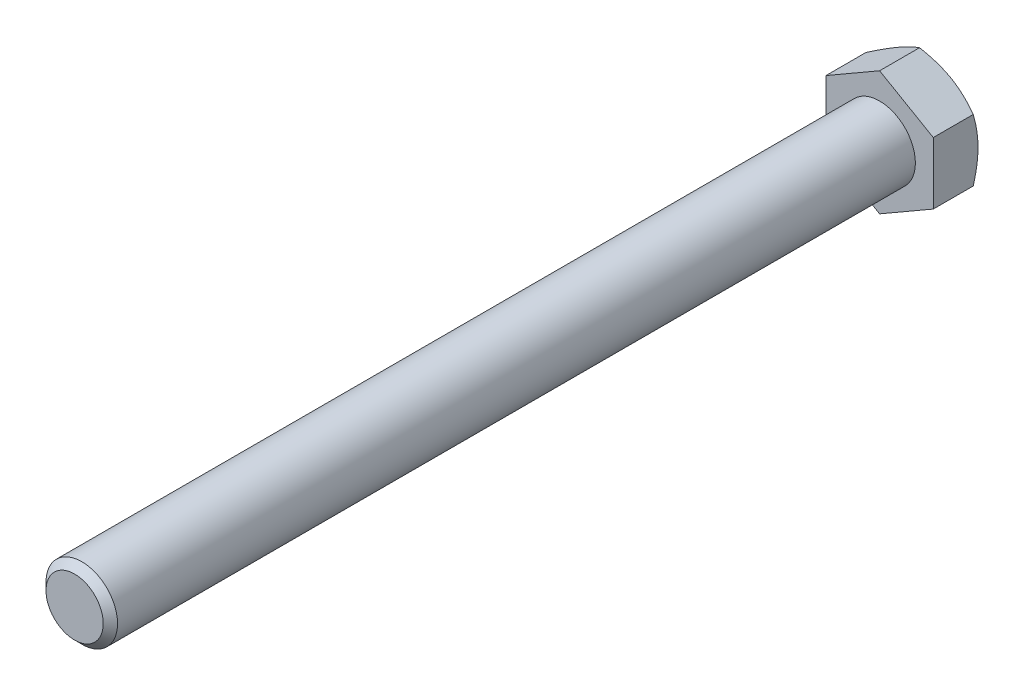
ISO-10303-21;
HEADER;
FILE_DESCRIPTION(('STEP AP214'),'2;1');
FILE_NAME('part.step','',(''),(''),'','','');
FILE_SCHEMA(('AUTOMOTIVE_DESIGN { 1 0 10303 214 1 1 1 1 }'));
ENDSEC;
DATA;
#1=APPLICATION_CONTEXT('core data for automotive mechanical design processes');
#2=APPLICATION_PROTOCOL_DEFINITION('international standard','automotive_design',2000,#1);
#3=PRODUCT_CONTEXT('',#1,'mechanical');
#4=PRODUCT('Part','Part','',(#3));
#5=PRODUCT_RELATED_PRODUCT_CATEGORY('part','',(#4));
#6=PRODUCT_DEFINITION_FORMATION('','',#4);
#7=PRODUCT_DEFINITION_CONTEXT('part definition',#1,'design');
#8=PRODUCT_DEFINITION('design','',#6,#7);
#9=PRODUCT_DEFINITION_SHAPE('','',#8);
#10=(LENGTH_UNIT() NAMED_UNIT(*) SI_UNIT(.MILLI.,.METRE.));
#11=(NAMED_UNIT(*) PLANE_ANGLE_UNIT() SI_UNIT($,.RADIAN.));
#12=(NAMED_UNIT(*) SI_UNIT($,.STERADIAN.) SOLID_ANGLE_UNIT());
#13=UNCERTAINTY_MEASURE_WITH_UNIT(LENGTH_MEASURE(1.E-05),#10,'distance_accuracy_value','');
#14=(GEOMETRIC_REPRESENTATION_CONTEXT(3) GLOBAL_UNCERTAINTY_ASSIGNED_CONTEXT((#13)) GLOBAL_UNIT_ASSIGNED_CONTEXT((#10,
#11,#12)) REPRESENTATION_CONTEXT('',''));
#15=CARTESIAN_POINT('',(0.,0.,0.));
#16=DIRECTION('',(0.,0.,1.));
#17=DIRECTION('',(1.,0.,0.));
#18=AXIS2_PLACEMENT_3D('',#15,#16,#17);
#19=CARTESIAN_POINT('',(0.,0.,180.));
#20=DIRECTION('',(0.,0.,1.));
#21=DIRECTION('',(1.,0.,0.));
#22=AXIS2_PLACEMENT_3D('',#19,#20,#21);
#23=PLANE('',#22);
#24=CARTESIAN_POINT('',(0.,0.,180.));
#25=DIRECTION('',(0.,0.,1.));
#26=DIRECTION('',(1.,0.,0.));
#27=AXIS2_PLACEMENT_3D('',#24,#25,#26);
#28=CIRCLE('',#27,6.39999999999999);
#29=CARTESIAN_POINT('',(6.40000000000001,0.,180.));
#30=VERTEX_POINT('',#29);
#31=EDGE_CURVE('E203',#30,#30,#28,.T.);
#32=ORIENTED_EDGE('',*,*,#31,.T.);
#33=EDGE_LOOP('',(#32));
#34=FACE_BOUND('',#33,.T.);
#35=ADVANCED_FACE('F29',(#34),#23,.T.);
#36=CARTESIAN_POINT('',(0.,0.,0.));
#37=DIRECTION('',(0.,0.,1.));
#38=DIRECTION('',(1.,0.,0.));
#39=AXIS2_PLACEMENT_3D('',#36,#37,#38);
#40=CYLINDRICAL_SURFACE('',#39,8.);
#41=CARTESIAN_POINT('',(0.,0.,178.4));
#42=DIRECTION('',(0.,0.,1.));
#43=DIRECTION('',(1.,0.,0.));
#44=AXIS2_PLACEMENT_3D('',#41,#42,#43);
#45=CIRCLE('',#44,8.);
#46=CARTESIAN_POINT('',(8.00000000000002,0.,178.4));
#47=VERTEX_POINT('',#46);
#48=EDGE_CURVE('E205',#47,#47,#45,.F.);
#49=ORIENTED_EDGE('',*,*,#48,.T.);
#50=EDGE_LOOP('',(#49));
#51=FACE_BOUND('',#50,.T.);
#52=CARTESIAN_POINT('',(0.,0.,0.));
#53=DIRECTION('',(0.,0.,1.));
#54=DIRECTION('',(1.,0.,0.));
#55=AXIS2_PLACEMENT_3D('',#52,#53,#54);
#56=CIRCLE('',#55,8.);
#57=CARTESIAN_POINT('',(8.,0.,0.));
#58=VERTEX_POINT('',#57);
#59=EDGE_CURVE('E206',#58,#58,#56,.F.);
#60=ORIENTED_EDGE('',*,*,#59,.F.);
#61=EDGE_LOOP('',(#60));
#62=FACE_BOUND('',#61,.T.);
#63=ADVANCED_FACE('F194',(#51,#62),#40,.T.);
#64=CARTESIAN_POINT('',(0.,0.,180.));
#65=DIRECTION('',(0.,0.,-1.));
#66=DIRECTION('',(-1.,0.,0.));
#67=AXIS2_PLACEMENT_3D('',#64,#65,#66);
#68=CONICAL_SURFACE('',#67,6.39999999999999,0.785398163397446);
#69=ORIENTED_EDGE('',*,*,#48,.F.);
#70=EDGE_LOOP('',(#69));
#71=FACE_BOUND('',#70,.T.);
#72=ORIENTED_EDGE('',*,*,#31,.F.);
#73=EDGE_LOOP('',(#72));
#74=FACE_BOUND('',#73,.T.);
#75=ADVANCED_FACE('F199',(#71,#74),#68,.T.);
#76=CARTESIAN_POINT('',(0.,13.856406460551,-10.));
#77=DIRECTION('',(0.499999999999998,0.86602540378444,0.));
#78=DIRECTION('',(-0.86602540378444,0.499999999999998,0.));
#79=AXIS2_PLACEMENT_3D('',#76,#77,#78);
#80=PLANE('',#79);
#81=CARTESIAN_POINT('',(-0.000200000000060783,13.8565219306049,-8.9281365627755));
#82=CARTESIAN_POINT('',(0.263585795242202,13.7042251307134,-9.01605036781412));
#83=CARTESIAN_POINT('',(0.528355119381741,13.5513604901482,-9.09997400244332));
#84=CARTESIAN_POINT('',(1.0600170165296,13.2444053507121,-9.25873378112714));
#85=CARTESIAN_POINT('',(1.32691025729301,13.0903144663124,-9.3335669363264));
#86=CARTESIAN_POINT('',(2.13189040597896,12.6255589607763,-9.54298246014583));
#87=CARTESIAN_POINT('',(2.67315507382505,12.3130596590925,-9.66209676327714));
#88=CARTESIAN_POINT('',(3.48313282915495,11.8454187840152,-9.80176893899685));
#89=CARTESIAN_POINT('',(3.74942610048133,11.6916742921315,-9.84155620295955));
#90=CARTESIAN_POINT('',(4.2832455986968,11.3834734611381,-9.90827663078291));
#91=CARTESIAN_POINT('',(4.55077184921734,11.2290171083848,-9.93520954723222));
#92=CARTESIAN_POINT('',(5.08627036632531,10.9198468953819,-9.97553140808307));
#93=CARTESIAN_POINT('',(5.35424172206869,10.7651335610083,-9.98893644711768));
#94=CARTESIAN_POINT('',(5.890432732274,10.4555635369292,-10.0019169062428));
#95=CARTESIAN_POINT('',(6.158652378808,10.3007068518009,-10.0014927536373));
#96=CARTESIAN_POINT('',(6.66008937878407,10.0112020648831,-9.98777998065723));
#97=CARTESIAN_POINT('',(6.89334249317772,9.87653331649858,-9.97616401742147));
#98=CARTESIAN_POINT('',(7.35931224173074,9.60750555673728,-9.94269199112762));
#99=CARTESIAN_POINT('',(7.59202883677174,9.47314656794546,-9.92083520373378));
#100=CARTESIAN_POINT('',(8.05679907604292,9.20481134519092,-9.86726258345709));
#101=CARTESIAN_POINT('',(8.28885201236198,9.07083551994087,-9.83553860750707));
#102=CARTESIAN_POINT('',(8.75186996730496,8.80351197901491,-9.76278822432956));
#103=CARTESIAN_POINT('',(8.98283491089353,8.67016430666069,-9.7217611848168));
#104=CARTESIAN_POINT('',(9.68394195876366,8.26537996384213,-9.58368834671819));
#105=CARTESIAN_POINT('',(10.1520537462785,7.99511549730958,-9.47287511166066));
#106=CARTESIAN_POINT('',(11.0812971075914,7.45861659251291,-9.2213742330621));
#107=CARTESIAN_POINT('',(11.5424405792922,7.19237528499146,-9.0807456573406));
#108=CARTESIAN_POINT('',(12.0002,6.92808776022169,-8.92813656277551));
#109=B_SPLINE_CURVE_WITH_KNOTS('',3,(#81,#82,#83,#84,#85,#86,#87,#88,#89,#90,#91,#92,#93,#94,
#95,#96,#97,#98,#99,#100,#101,#102,#103,#104,#105,#106,#107,#108),.UNSPECIFIED.,.F.,.F.,(4,2,2,
2,2,2,2,2,2,2,2,2,2,4),(0.,0.951004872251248,1.90232158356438,3.8090046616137,4.73894551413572,
5.66890426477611,6.59775529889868,7.52657763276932,8.33514643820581,9.14377244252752,
9.95306755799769,10.7624176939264,12.4167102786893,14.0677556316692),.UNSPECIFIED.);
#110=CARTESIAN_POINT('',(0.,13.856406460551,-8.9282032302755));
#111=VERTEX_POINT('',#110);
#112=CARTESIAN_POINT('',(5.99999999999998,10.3923048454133,-10.));
#113=VERTEX_POINT('',#112);
#114=EDGE_CURVE('E239',#111,#113,#109,.T.);
#115=ORIENTED_EDGE('',*,*,#114,.F.);
#116=DIRECTION('',(0.,0.,1.));
#117=VECTOR('',#116,1.);
#118=CARTESIAN_POINT('',(0.,13.856406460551,-10.));
#119=LINE('',#118,#117);
#120=CARTESIAN_POINT('',(0.,13.856406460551,0.));
#121=VERTEX_POINT('',#120);
#122=EDGE_CURVE('E213',#111,#121,#119,.T.);
#123=ORIENTED_EDGE('',*,*,#122,.T.);
#124=DIRECTION('',(-0.86602540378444,0.499999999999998,0.));
#125=VECTOR('',#124,1.);
#126=CARTESIAN_POINT('',(0.,13.856406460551,0.));
#127=LINE('',#126,#125);
#128=CARTESIAN_POINT('',(12.,6.92820323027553,0.));
#129=VERTEX_POINT('',#128);
#130=EDGE_CURVE('E237',#129,#121,#127,.T.);
#131=ORIENTED_EDGE('',*,*,#130,.F.);
#132=DIRECTION('',(0.,0.,1.));
#133=VECTOR('',#132,1.);
#134=CARTESIAN_POINT('',(12.,6.92820323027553,-10.));
#135=LINE('',#134,#133);
#136=CARTESIAN_POINT('',(12.,6.92820323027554,-8.9282032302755));
#137=VERTEX_POINT('',#136);
#138=EDGE_CURVE('E210',#137,#129,#135,.T.);
#139=ORIENTED_EDGE('',*,*,#138,.F.);
#140=EDGE_CURVE('E169',#113,#137,#109,.T.);
#141=ORIENTED_EDGE('',*,*,#140,.F.);
#142=EDGE_LOOP('',(#115,#123,#131,#139,#141));
#143=FACE_BOUND('',#142,.T.);
#144=ADVANCED_FACE('F179',(#143),#80,.T.);
#145=CARTESIAN_POINT('',(12.,-6.92820323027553,-10.));
#146=DIRECTION('',(1.,0.,0.));
#147=DIRECTION('',(0.,0.,-1.));
#148=AXIS2_PLACEMENT_3D('',#145,#146,#147);
#149=PLANE('',#148);
#150=CARTESIAN_POINT('',(12.,-18.9250739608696,-3.99042361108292));
#151=CARTESIAN_POINT('',(12.,-18.6616294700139,-4.1188745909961));
#152=CARTESIAN_POINT('',(12.,-18.3978841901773,-4.24670838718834));
#153=CARTESIAN_POINT('',(12.,-17.869729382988,-4.50100240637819));
#154=CARTESIAN_POINT('',(12.,-17.6053198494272,-4.62746261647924));
#155=CARTESIAN_POINT('',(12.,-16.8109346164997,-5.00460542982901));
#156=CARTESIAN_POINT('',(12.,-16.2798755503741,-5.25301439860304));
#157=CARTESIAN_POINT('',(12.,-15.2115652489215,-5.74359590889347));
#158=CARTESIAN_POINT('',(12.,-14.6742962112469,-5.98572977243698));
#159=CARTESIAN_POINT('',(12.,-13.5955935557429,-6.46050256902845));
#160=CARTESIAN_POINT('',(12.,-13.054160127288,-6.69314193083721));
#161=CARTESIAN_POINT('',(12.,-11.9477551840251,-7.15413664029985));
#162=CARTESIAN_POINT('',(12.,-11.3826097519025,-7.38207667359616));
#163=CARTESIAN_POINT('',(12.,-10.2458209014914,-7.82145679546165));
#164=CARTESIAN_POINT('',(12.,-9.67417677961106,-8.03289507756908));
#165=CARTESIAN_POINT('',(12.,-8.5244701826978,-8.43394793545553));
#166=CARTESIAN_POINT('',(12.,-7.94642231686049,-8.62360406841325));
#167=CARTESIAN_POINT('',(12.,-6.78198793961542,-8.97522909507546));
#168=CARTESIAN_POINT('',(12.,-6.19560401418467,-9.13720638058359));
#169=CARTESIAN_POINT('',(12.,-5.311253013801,-9.35327296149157));
#170=CARTESIAN_POINT('',(12.,-5.0165168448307,-9.42065839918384));
#171=CARTESIAN_POINT('',(12.,-4.42497462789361,-9.54568693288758));
#172=CARTESIAN_POINT('',(12.,-4.12816861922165,-9.60333021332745));
#173=CARTESIAN_POINT('',(12.,-3.53266972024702,-9.7078772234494));
#174=CARTESIAN_POINT('',(12.,-3.23397688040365,-9.75478123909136));
#175=CARTESIAN_POINT('',(12.,-2.63499315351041,-9.8369274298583));
#176=CARTESIAN_POINT('',(12.,-2.33470233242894,-9.87217008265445));
#177=CARTESIAN_POINT('',(12.,-1.73700046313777,-9.9298331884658));
#178=CARTESIAN_POINT('',(12.,-1.43960568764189,-9.95242127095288));
#179=CARTESIAN_POINT('',(12.,-0.84412690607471,-9.98498816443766));
#180=CARTESIAN_POINT('',(12.,-0.54604291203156,-9.99496719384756));
#181=CARTESIAN_POINT('',(12.,0.0502829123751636,-10.002076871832));
#182=CARTESIAN_POINT('',(12.,0.348524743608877,-9.99920744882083));
#183=CARTESIAN_POINT('',(12.,0.944614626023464,-9.9806935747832));
#184=CARTESIAN_POINT('',(12.,1.24246265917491,-9.96504855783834));
#185=CARTESIAN_POINT('',(12.,1.94883669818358,-9.91313385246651));
#186=CARTESIAN_POINT('',(12.,2.3569653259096,-9.87132867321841));
#187=CARTESIAN_POINT('',(12.,3.17037872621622,-9.7659412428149));
#188=CARTESIAN_POINT('',(12.,3.57566314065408,-9.70235629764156));
#189=CARTESIAN_POINT('',(12.,4.78667114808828,-9.48228853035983));
#190=CARTESIAN_POINT('',(12.,5.58715478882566,-9.29652578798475));
#191=CARTESIAN_POINT('',(12.,6.78477534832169,-8.97197381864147));
#192=CARTESIAN_POINT('',(12.,7.18805346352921,-8.85452170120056));
#193=CARTESIAN_POINT('',(12.,7.99069893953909,-8.60681919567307));
#194=CARTESIAN_POINT('',(12.,8.39006626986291,-8.47656870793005));
#195=CARTESIAN_POINT('',(12.,9.18500745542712,-8.20540698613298));
#196=CARTESIAN_POINT('',(12.,9.58058232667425,-8.06449870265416));
#197=CARTESIAN_POINT('',(12.,10.3684152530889,-7.7737455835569));
#198=CARTESIAN_POINT('',(12.,10.7606733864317,-7.62390095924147));
#199=CARTESIAN_POINT('',(12.,11.4875161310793,-7.33823544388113));
#200=CARTESIAN_POINT('',(12.,11.8224853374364,-7.20338895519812));
#201=CARTESIAN_POINT('',(12.,12.4904657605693,-6.92892402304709));
#202=CARTESIAN_POINT('',(12.,12.8234769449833,-6.7893055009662));
#203=CARTESIAN_POINT('',(12.,13.8199414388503,-6.364274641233));
#204=CARTESIAN_POINT('',(12.,14.4807713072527,-6.07270863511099));
#205=CARTESIAN_POINT('',(12.,15.7970784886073,-5.47713534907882));
#206=CARTESIAN_POINT('',(12.,16.4525535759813,-5.17312318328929));
#207=CARTESIAN_POINT('',(12.,17.7589886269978,-4.55563924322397));
#208=CARTESIAN_POINT('',(12.,18.4099487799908,-4.24216786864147));
#209=CARTESIAN_POINT('',(12.,19.7093218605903,-3.60732416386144));
#210=CARTESIAN_POINT('',(12.,20.357728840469,-3.28593969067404));
#211=CARTESIAN_POINT('',(12.,21.6516057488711,-2.63730730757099));
#212=CARTESIAN_POINT('',(12.,22.2970756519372,-2.31005934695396));
#213=CARTESIAN_POINT('',(12.,23.5854613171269,-1.65093387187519));
#214=CARTESIAN_POINT('',(12.,24.2283776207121,-1.31905741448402));
#215=CARTESIAN_POINT('',(12.,25.5122149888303,-0.651476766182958));
#216=CARTESIAN_POINT('',(12.,26.1531360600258,-0.315772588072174));
#217=CARTESIAN_POINT('',(12.,27.9362828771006,0.623783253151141));
#218=CARTESIAN_POINT('',(12.,29.0767003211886,1.23106608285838));
#219=CARTESIAN_POINT('',(12.,31.3537253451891,2.45288949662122));
#220=CARTESIAN_POINT('',(12.,32.4903326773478,3.06743054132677));
#221=CARTESIAN_POINT('',(12.,34.7567241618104,4.29980771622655));
#222=CARTESIAN_POINT('',(12.,35.8865183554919,4.91762539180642));
#223=CARTESIAN_POINT('',(12.,37.5794668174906,5.84741408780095));
#224=CARTESIAN_POINT('',(12.,38.143469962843,6.1578415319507));
#225=CARTESIAN_POINT('',(12.,39.2709710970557,6.77961088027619));
#226=CARTESIAN_POINT('',(12.,39.8344690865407,7.09095278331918));
#227=CARTESIAN_POINT('',(12.,40.3977455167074,7.40269511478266));
#228=B_SPLINE_CURVE_WITH_KNOTS('',3,(#150,#151,#152,#153,#154,#155,#156,#157,#158,#159,#160,
#161,#162,#163,#164,#165,#166,#167,#168,#169,#170,#171,#172,#173,#174,#175,#176,#177,#178,#179,
#180,#181,#182,#183,#184,#185,#186,#187,#188,#189,#190,#191,#192,#193,#194,#195,#196,#197,#198,
#199,#200,#201,#202,#203,#204,#205,#206,#207,#208,#209,#210,#211,#212,#213,#214,#215,#216,#217,
#218,#219,#220,#221,#222,#223,#224,#225,#226,#227),.UNSPECIFIED.,.F.,.F.,(4,2,2,2,2,2,2,2,2,2,2,
2,2,2,2,2,2,2,2,2,2,2,2,2,2,2,2,2,2,2,2,2,2,2,2,2,2,2,4),(0.,0.879273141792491,1.75855453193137,
3.51736195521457,5.28522162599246,7.05300137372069,8.88094951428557,10.7090974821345,
12.5336975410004,14.3577434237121,15.264632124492,16.1715036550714,17.0783510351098,
17.9851612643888,18.8796567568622,19.7741367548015,20.6686217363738,21.5631463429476,
22.7932504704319,24.0235068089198,26.4852023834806,27.7451892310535,29.0051858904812,
30.2648349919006,31.5244543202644,32.6076922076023,33.6909479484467,35.8576349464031,
38.0251808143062,40.1926352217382,42.3636532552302,44.5346900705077,46.7052389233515,
48.8757805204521,52.7518329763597,56.6281327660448,60.4911769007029,62.4225443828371,
64.3539094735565),.UNSPECIFIED.);
#229=CARTESIAN_POINT('',(12.,0.,-10.));
#230=VERTEX_POINT('',#229);
#231=EDGE_CURVE('E167',#137,#230,#228,.F.);
#232=ORIENTED_EDGE('',*,*,#231,.F.);
#233=ORIENTED_EDGE('',*,*,#138,.T.);
#234=DIRECTION('',(0.,1.,0.));
#235=VECTOR('',#234,1.);
#236=CARTESIAN_POINT('',(12.,-6.92820323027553,0.));
#237=LINE('',#236,#235);
#238=CARTESIAN_POINT('',(12.,-6.92820323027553,0.));
#239=VERTEX_POINT('',#238);
#240=EDGE_CURVE('E215',#239,#129,#237,.T.);
#241=ORIENTED_EDGE('',*,*,#240,.F.);
#242=DIRECTION('',(0.,0.,1.));
#243=VECTOR('',#242,1.);
#244=CARTESIAN_POINT('',(12.,-6.92820323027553,-10.));
#245=LINE('',#244,#243);
#246=CARTESIAN_POINT('',(12.,-6.92820323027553,-8.9282032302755));
#247=VERTEX_POINT('',#246);
#248=EDGE_CURVE('E221',#247,#239,#245,.T.);
#249=ORIENTED_EDGE('',*,*,#248,.F.);
#250=EDGE_CURVE('E162',#230,#247,#228,.F.);
#251=ORIENTED_EDGE('',*,*,#250,.F.);
#252=EDGE_LOOP('',(#232,#233,#241,#249,#251));
#253=FACE_BOUND('',#252,.T.);
#254=ADVANCED_FACE('F175',(#253),#149,.T.);
#255=CARTESIAN_POINT('',(0.,-13.856406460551,-10.));
#256=DIRECTION('',(0.499999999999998,-0.86602540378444,0.));
#257=DIRECTION('',(0.86602540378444,0.499999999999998,0.));
#258=AXIS2_PLACEMENT_3D('',#255,#256,#257);
#259=PLANE('',#258);
#260=CARTESIAN_POINT('',(12.0002,-6.92808776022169,-8.92813656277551));
#261=CARTESIAN_POINT('',(11.7364142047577,-7.08038456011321,-9.01605036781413));
#262=CARTESIAN_POINT('',(11.4716448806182,-7.23324920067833,-9.09997400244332));
#263=CARTESIAN_POINT('',(10.9399829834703,-7.54020434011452,-9.25873378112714));
#264=CARTESIAN_POINT('',(10.6730897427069,-7.69429522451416,-9.3335669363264));
#265=CARTESIAN_POINT('',(9.86810959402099,-8.15905073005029,-9.54298246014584));
#266=CARTESIAN_POINT('',(9.32684492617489,-8.47155003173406,-9.66209676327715));
#267=CARTESIAN_POINT('',(8.51686717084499,-8.93919090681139,-9.80176893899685));
#268=CARTESIAN_POINT('',(8.25057389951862,-9.09293539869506,-9.84155620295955));
#269=CARTESIAN_POINT('',(7.71675440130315,-9.40113622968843,-9.90827663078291));
#270=CARTESIAN_POINT('',(7.4492281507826,-9.55559258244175,-9.93520954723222));
#271=CARTESIAN_POINT('',(6.91372963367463,-9.86476279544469,-9.97553140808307));
#272=CARTESIAN_POINT('',(6.64575827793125,-10.0194761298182,-9.98893644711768));
#273=CARTESIAN_POINT('',(6.10956726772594,-10.3290461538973,-10.0019169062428));
#274=CARTESIAN_POINT('',(5.84134762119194,-10.4839028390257,-10.0014927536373));
#275=CARTESIAN_POINT('',(5.33991062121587,-10.7734076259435,-9.98777998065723));
#276=CARTESIAN_POINT('',(5.10665750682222,-10.908076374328,-9.97616401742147));
#277=CARTESIAN_POINT('',(4.64068775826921,-11.1771041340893,-9.94269199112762));
#278=CARTESIAN_POINT('',(4.4079711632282,-11.3114631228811,-9.92083520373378));
#279=CARTESIAN_POINT('',(3.94320092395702,-11.5797983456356,-9.86726258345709));
#280=CARTESIAN_POINT('',(3.71114798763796,-11.7137741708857,-9.83553860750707));
#281=CARTESIAN_POINT('',(3.24813003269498,-11.9810977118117,-9.76278822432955));
#282=CARTESIAN_POINT('',(3.01716508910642,-12.1144453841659,-9.72176118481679));
#283=CARTESIAN_POINT('',(2.31605804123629,-12.5192297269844,-9.58368834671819));
#284=CARTESIAN_POINT('',(1.84794625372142,-12.789494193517,-9.47287511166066));
#285=CARTESIAN_POINT('',(0.918702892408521,-13.3259930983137,-9.2213742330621));
#286=CARTESIAN_POINT('',(0.457559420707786,-13.5922344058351,-9.0807456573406));
#287=CARTESIAN_POINT('',(-0.000200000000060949,-13.8565219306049,-8.9281365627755));
#288=B_SPLINE_CURVE_WITH_KNOTS('',3,(#260,#261,#262,#263,#264,#265,#266,#267,#268,#269,#270,
#271,#272,#273,#274,#275,#276,#277,#278,#279,#280,#281,#282,#283,#284,#285,#286,#287),
.UNSPECIFIED.,.F.,.F.,(4,2,2,2,2,2,2,2,2,2,2,2,2,4),(0.,0.951004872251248,1.90232158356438,
3.8090046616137,4.73894551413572,5.66890426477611,6.59775529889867,7.52657763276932,
8.33514643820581,9.14377244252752,9.95306755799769,10.7624176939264,12.4167102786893,
14.0677556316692),.UNSPECIFIED.);
#289=CARTESIAN_POINT('',(5.99999999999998,-10.3923048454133,-10.));
#290=VERTEX_POINT('',#289);
#291=EDGE_CURVE('E168',#247,#290,#288,.T.);
#292=ORIENTED_EDGE('',*,*,#291,.F.);
#293=ORIENTED_EDGE('',*,*,#248,.T.);
#294=DIRECTION('',(0.86602540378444,0.499999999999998,0.));
#295=VECTOR('',#294,1.);
#296=CARTESIAN_POINT('',(0.,-13.856406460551,0.));
#297=LINE('',#296,#295);
#298=CARTESIAN_POINT('',(0.,-13.856406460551,0.));
#299=VERTEX_POINT('',#298);
#300=EDGE_CURVE('E226',#299,#239,#297,.T.);
#301=ORIENTED_EDGE('',*,*,#300,.F.);
#302=DIRECTION('',(0.,0.,1.));
#303=VECTOR('',#302,1.);
#304=CARTESIAN_POINT('',(0.,-13.856406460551,-10.));
#305=LINE('',#304,#303);
#306=CARTESIAN_POINT('',(0.,-13.856406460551,-8.9282032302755));
#307=VERTEX_POINT('',#306);
#308=EDGE_CURVE('E219',#307,#299,#305,.T.);
#309=ORIENTED_EDGE('',*,*,#308,.F.);
#310=EDGE_CURVE('E156',#290,#307,#288,.T.);
#311=ORIENTED_EDGE('',*,*,#310,.F.);
#312=EDGE_LOOP('',(#292,#293,#301,#309,#311));
#313=FACE_BOUND('',#312,.T.);
#314=ADVANCED_FACE('F178',(#313),#259,.T.);
#315=CARTESIAN_POINT('',(0.,-13.856406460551,-10.));
#316=DIRECTION('',(-0.500000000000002,-0.866025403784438,0.));
#317=DIRECTION('',(0.866025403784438,-0.500000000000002,0.));
#318=AXIS2_PLACEMENT_3D('',#315,#316,#317);
#319=PLANE('',#318);
#320=CARTESIAN_POINT('',(0.000199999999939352,-13.8565219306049,-8.9281365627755));
#321=CARTESIAN_POINT('',(-0.263585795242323,-13.7042251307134,-9.01605036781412));
#322=CARTESIAN_POINT('',(-0.528355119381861,-13.5513604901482,-9.09997400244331));
#323=CARTESIAN_POINT('',(-1.06001701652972,-13.2444053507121,-9.25873378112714));
#324=CARTESIAN_POINT('',(-1.32691025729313,-13.0903144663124,-9.3335669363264));
#325=CARTESIAN_POINT('',(-2.13189040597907,-12.6255589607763,-9.54298246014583));
#326=CARTESIAN_POINT('',(-2.67315507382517,-12.3130596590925,-9.66209676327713));
#327=CARTESIAN_POINT('',(-3.48313282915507,-11.8454187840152,-9.80176893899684));
#328=CARTESIAN_POINT('',(-3.74942610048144,-11.6916742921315,-9.84155620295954));
#329=CARTESIAN_POINT('',(-4.28324559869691,-11.3834734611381,-9.9082766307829));
#330=CARTESIAN_POINT('',(-4.55077184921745,-11.2290171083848,-9.93520954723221));
#331=CARTESIAN_POINT('',(-5.08627036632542,-10.9198468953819,-9.97553140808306));
#332=CARTESIAN_POINT('',(-5.3542417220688,-10.7651335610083,-9.98893644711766));
#333=CARTESIAN_POINT('',(-5.89043273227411,-10.4555635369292,-10.0019169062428));
#334=CARTESIAN_POINT('',(-6.15865237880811,-10.3007068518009,-10.0014927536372));
#335=CARTESIAN_POINT('',(-6.66008937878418,-10.011202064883,-9.9877799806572));
#336=CARTESIAN_POINT('',(-6.89334249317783,-9.87653331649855,-9.97616401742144));
#337=CARTESIAN_POINT('',(-7.35931224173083,-9.60750555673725,-9.9426919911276));
#338=CARTESIAN_POINT('',(-7.59202883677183,-9.47314656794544,-9.92083520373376));
#339=CARTESIAN_POINT('',(-8.056799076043,-9.2048113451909,-9.86726258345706));
#340=CARTESIAN_POINT('',(-8.28885201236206,-9.07083551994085,-9.83553860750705));
#341=CARTESIAN_POINT('',(-8.75186996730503,-8.80351197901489,-9.76278822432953));
#342=CARTESIAN_POINT('',(-8.98283491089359,-8.67016430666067,-9.72176118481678));
#343=CARTESIAN_POINT('',(-9.68394195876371,-8.26537996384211,-9.58368834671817));
#344=CARTESIAN_POINT('',(-10.1520537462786,-7.99511549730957,-9.47287511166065));
#345=CARTESIAN_POINT('',(-11.0812971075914,-7.45861659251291,-9.22137423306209));
#346=CARTESIAN_POINT('',(-11.5424405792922,-7.19237528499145,-9.0807456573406));
#347=CARTESIAN_POINT('',(-12.0002,-6.92808776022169,-8.9281365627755));
#348=B_SPLINE_CURVE_WITH_KNOTS('',3,(#320,#321,#322,#323,#324,#325,#326,#327,#328,#329,#330,
#331,#332,#333,#334,#335,#336,#337,#338,#339,#340,#341,#342,#343,#344,#345,#346,#347),
.UNSPECIFIED.,.F.,.F.,(4,2,2,2,2,2,2,2,2,2,2,2,2,4),(0.,0.951004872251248,1.90232158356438,
3.8090046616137,4.73894551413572,5.66890426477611,6.59775529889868,7.52657763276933,
8.3351464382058,9.1437724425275,9.95306755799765,10.7624176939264,12.4167102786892,
14.0677556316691),.UNSPECIFIED.);
#349=CARTESIAN_POINT('',(-6.00000000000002,-10.3923048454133,-10.));
#350=VERTEX_POINT('',#349);
#351=EDGE_CURVE('E258',#307,#350,#348,.T.);
#352=ORIENTED_EDGE('',*,*,#351,.F.);
#353=ORIENTED_EDGE('',*,*,#308,.T.);
#354=DIRECTION('',(0.866025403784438,-0.500000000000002,0.));
#355=VECTOR('',#354,1.);
#356=CARTESIAN_POINT('',(0.,-13.856406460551,0.));
#357=LINE('',#356,#355);
#358=CARTESIAN_POINT('',(-12.,-6.92820323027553,0.));
#359=VERTEX_POINT('',#358);
#360=EDGE_CURVE('E229',#359,#299,#357,.T.);
#361=ORIENTED_EDGE('',*,*,#360,.F.);
#362=DIRECTION('',(0.,0.,1.));
#363=VECTOR('',#362,1.);
#364=CARTESIAN_POINT('',(-12.,-6.92820323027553,-10.));
#365=LINE('',#364,#363);
#366=CARTESIAN_POINT('',(-12.,-6.92820323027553,-8.9282032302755));
#367=VERTEX_POINT('',#366);
#368=EDGE_CURVE('E217',#367,#359,#365,.T.);
#369=ORIENTED_EDGE('',*,*,#368,.F.);
#370=EDGE_CURVE('E105',#350,#367,#348,.T.);
#371=ORIENTED_EDGE('',*,*,#370,.F.);
#372=EDGE_LOOP('',(#352,#353,#361,#369,#371));
#373=FACE_BOUND('',#372,.T.);
#374=ADVANCED_FACE('F183',(#373),#319,.T.);
#375=CARTESIAN_POINT('',(-12.,-6.92820323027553,-10.));
#376=DIRECTION('',(-1.,0.,0.));
#377=DIRECTION('',(0.,0.,1.));
#378=AXIS2_PLACEMENT_3D('',#375,#376,#377);
#379=PLANE('',#378);
#380=CARTESIAN_POINT('',(-12.,-18.9250739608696,-3.99042361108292));
#381=CARTESIAN_POINT('',(-12.,-18.6616294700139,-4.1188745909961));
#382=CARTESIAN_POINT('',(-12.,-18.3978841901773,-4.24670838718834));
#383=CARTESIAN_POINT('',(-12.,-17.869729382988,-4.50100240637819));
#384=CARTESIAN_POINT('',(-12.,-17.6053198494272,-4.62746261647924));
#385=CARTESIAN_POINT('',(-12.,-16.8109346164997,-5.00460542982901));
#386=CARTESIAN_POINT('',(-12.,-16.2798755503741,-5.25301439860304));
#387=CARTESIAN_POINT('',(-12.,-15.2115652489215,-5.74359590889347));
#388=CARTESIAN_POINT('',(-12.,-14.6742962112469,-5.98572977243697));
#389=CARTESIAN_POINT('',(-12.,-13.5955935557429,-6.46050256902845));
#390=CARTESIAN_POINT('',(-12.,-13.054160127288,-6.69314193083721));
#391=CARTESIAN_POINT('',(-12.,-11.9477551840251,-7.15413664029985));
#392=CARTESIAN_POINT('',(-12.,-11.3826097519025,-7.38207667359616));
#393=CARTESIAN_POINT('',(-12.,-10.2458209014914,-7.82145679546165));
#394=CARTESIAN_POINT('',(-12.,-9.67417677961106,-8.03289507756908));
#395=CARTESIAN_POINT('',(-12.,-8.5244701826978,-8.43394793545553));
#396=CARTESIAN_POINT('',(-12.,-7.9464223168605,-8.62360406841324));
#397=CARTESIAN_POINT('',(-12.,-6.78198793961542,-8.97522909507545));
#398=CARTESIAN_POINT('',(-12.,-6.19560401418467,-9.13720638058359));
#399=CARTESIAN_POINT('',(-12.,-5.31125301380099,-9.35327296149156));
#400=CARTESIAN_POINT('',(-12.,-5.0165168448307,-9.42065839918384));
#401=CARTESIAN_POINT('',(-12.,-4.42497462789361,-9.54568693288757));
#402=CARTESIAN_POINT('',(-12.,-4.12816861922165,-9.60333021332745));
#403=CARTESIAN_POINT('',(-12.,-3.53266972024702,-9.7078772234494));
#404=CARTESIAN_POINT('',(-12.,-3.23397688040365,-9.75478123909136));
#405=CARTESIAN_POINT('',(-12.,-2.63499315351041,-9.8369274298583));
#406=CARTESIAN_POINT('',(-12.,-2.33470233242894,-9.87217008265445));
#407=CARTESIAN_POINT('',(-12.,-1.73700046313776,-9.9298331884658));
#408=CARTESIAN_POINT('',(-12.,-1.43960568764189,-9.95242127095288));
#409=CARTESIAN_POINT('',(-12.,-0.84412690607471,-9.98498816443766));
#410=CARTESIAN_POINT('',(-12.,-0.546042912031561,-9.99496719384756));
#411=CARTESIAN_POINT('',(-12.,0.0502829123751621,-10.0020768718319));
#412=CARTESIAN_POINT('',(-12.,0.348524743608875,-9.99920744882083));
#413=CARTESIAN_POINT('',(-12.,0.944614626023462,-9.9806935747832));
#414=CARTESIAN_POINT('',(-12.,1.2424626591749,-9.96504855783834));
#415=CARTESIAN_POINT('',(-12.,1.94883669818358,-9.91313385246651));
#416=CARTESIAN_POINT('',(-12.,2.35696532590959,-9.87132867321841));
#417=CARTESIAN_POINT('',(-12.,3.17037872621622,-9.7659412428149));
#418=CARTESIAN_POINT('',(-12.,3.57566314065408,-9.70235629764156));
#419=CARTESIAN_POINT('',(-12.,4.78667114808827,-9.48228853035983));
#420=CARTESIAN_POINT('',(-12.,5.58715478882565,-9.29652578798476));
#421=CARTESIAN_POINT('',(-12.,6.78477534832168,-8.97197381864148));
#422=CARTESIAN_POINT('',(-12.,7.1880534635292,-8.85452170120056));
#423=CARTESIAN_POINT('',(-12.,7.99069893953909,-8.60681919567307));
#424=CARTESIAN_POINT('',(-12.,8.3900662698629,-8.47656870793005));
#425=CARTESIAN_POINT('',(-12.,9.18500745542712,-8.20540698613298));
#426=CARTESIAN_POINT('',(-12.,9.58058232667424,-8.06449870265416));
#427=CARTESIAN_POINT('',(-12.,10.3684152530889,-7.77374558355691));
#428=CARTESIAN_POINT('',(-12.,10.7606733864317,-7.62390095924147));
#429=CARTESIAN_POINT('',(-12.,11.4875161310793,-7.33823544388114));
#430=CARTESIAN_POINT('',(-12.,11.8224853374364,-7.20338895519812));
#431=CARTESIAN_POINT('',(-12.,12.4904657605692,-6.92892402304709));
#432=CARTESIAN_POINT('',(-12.,12.8234769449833,-6.7893055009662));
#433=CARTESIAN_POINT('',(-12.,13.8199414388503,-6.36427464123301));
#434=CARTESIAN_POINT('',(-12.,14.4807713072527,-6.072708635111));
#435=CARTESIAN_POINT('',(-12.,15.7970784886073,-5.47713534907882));
#436=CARTESIAN_POINT('',(-12.,16.4525535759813,-5.17312318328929));
#437=CARTESIAN_POINT('',(-12.,17.7589886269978,-4.55563924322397));
#438=CARTESIAN_POINT('',(-12.,18.4099487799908,-4.24216786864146));
#439=CARTESIAN_POINT('',(-12.,19.7093218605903,-3.60732416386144));
#440=CARTESIAN_POINT('',(-12.,20.357728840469,-3.28593969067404));
#441=CARTESIAN_POINT('',(-12.,21.6516057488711,-2.63730730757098));
#442=CARTESIAN_POINT('',(-12.,22.2970756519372,-2.31005934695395));
#443=CARTESIAN_POINT('',(-12.,23.5854613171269,-1.65093387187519));
#444=CARTESIAN_POINT('',(-12.,24.2283776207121,-1.31905741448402));
#445=CARTESIAN_POINT('',(-12.,25.5122149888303,-0.651476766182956));
#446=CARTESIAN_POINT('',(-12.,26.1531360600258,-0.315772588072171));
#447=CARTESIAN_POINT('',(-12.,27.9362828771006,0.623783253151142));
#448=CARTESIAN_POINT('',(-12.,29.0767003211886,1.23106608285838));
#449=CARTESIAN_POINT('',(-12.,31.3537253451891,2.45288949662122));
#450=CARTESIAN_POINT('',(-12.,32.4903326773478,3.06743054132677));
#451=CARTESIAN_POINT('',(-12.,34.7567241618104,4.29980771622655));
#452=CARTESIAN_POINT('',(-12.,35.8865183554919,4.91762539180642));
#453=CARTESIAN_POINT('',(-12.,37.5794668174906,5.84741408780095));
#454=CARTESIAN_POINT('',(-12.,38.143469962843,6.1578415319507));
#455=CARTESIAN_POINT('',(-12.,39.2709710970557,6.77961088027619));
#456=CARTESIAN_POINT('',(-12.,39.8344690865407,7.09095278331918));
#457=CARTESIAN_POINT('',(-12.,40.3977455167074,7.40269511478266));
#458=B_SPLINE_CURVE_WITH_KNOTS('',3,(#380,#381,#382,#383,#384,#385,#386,#387,#388,#389,#390,
#391,#392,#393,#394,#395,#396,#397,#398,#399,#400,#401,#402,#403,#404,#405,#406,#407,#408,#409,
#410,#411,#412,#413,#414,#415,#416,#417,#418,#419,#420,#421,#422,#423,#424,#425,#426,#427,#428,
#429,#430,#431,#432,#433,#434,#435,#436,#437,#438,#439,#440,#441,#442,#443,#444,#445,#446,#447,
#448,#449,#450,#451,#452,#453,#454,#455,#456,#457),.UNSPECIFIED.,.F.,.F.,(4,2,2,2,2,2,2,2,2,2,2,
2,2,2,2,2,2,2,2,2,2,2,2,2,2,2,2,2,2,2,2,2,2,2,2,2,2,2,4),(0.,0.87927314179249,1.75855453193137,
3.51736195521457,5.28522162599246,7.05300137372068,8.88094951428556,10.7090974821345,
12.5336975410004,14.3577434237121,15.264632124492,16.1715036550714,17.0783510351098,
17.9851612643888,18.8796567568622,19.7741367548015,20.6686217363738,21.5631463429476,
22.7932504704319,24.0235068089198,26.4852023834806,27.7451892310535,29.0051858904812,
30.2648349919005,31.5244543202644,32.6076922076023,33.6909479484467,35.8576349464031,
38.0251808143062,40.1926352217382,42.3636532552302,44.5346900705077,46.7052389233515,
48.8757805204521,52.7518329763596,56.6281327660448,60.4911769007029,62.4225443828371,
64.3539094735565),.UNSPECIFIED.);
#459=CARTESIAN_POINT('',(-12.,0.,-10.));
#460=VERTEX_POINT('',#459);
#461=EDGE_CURVE('E100',#367,#460,#458,.T.);
#462=ORIENTED_EDGE('',*,*,#461,.F.);
#463=ORIENTED_EDGE('',*,*,#368,.T.);
#464=DIRECTION('',(0.,-1.,0.));
#465=VECTOR('',#464,1.);
#466=CARTESIAN_POINT('',(-12.,-6.92820323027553,0.));
#467=LINE('',#466,#465);
#468=CARTESIAN_POINT('',(-12.,6.92820323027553,0.));
#469=VERTEX_POINT('',#468);
#470=EDGE_CURVE('E232',#469,#359,#467,.T.);
#471=ORIENTED_EDGE('',*,*,#470,.F.);
#472=DIRECTION('',(0.,0.,1.));
#473=VECTOR('',#472,1.);
#474=CARTESIAN_POINT('',(-12.,6.92820323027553,-10.));
#475=LINE('',#474,#473);
#476=CARTESIAN_POINT('',(-12.,6.92820323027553,-8.9282032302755));
#477=VERTEX_POINT('',#476);
#478=EDGE_CURVE('E126',#477,#469,#475,.T.);
#479=ORIENTED_EDGE('',*,*,#478,.F.);
#480=EDGE_CURVE('E109',#460,#477,#458,.T.);
#481=ORIENTED_EDGE('',*,*,#480,.F.);
#482=EDGE_LOOP('',(#462,#463,#471,#479,#481));
#483=FACE_BOUND('',#482,.T.);
#484=ADVANCED_FACE('F124',(#483),#379,.T.);
#485=CARTESIAN_POINT('',(-12.,6.92820323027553,-10.));
#486=DIRECTION('',(-0.500000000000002,0.866025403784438,0.));
#487=DIRECTION('',(-0.866025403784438,-0.500000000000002,0.));
#488=AXIS2_PLACEMENT_3D('',#485,#486,#487);
#489=PLANE('',#488);
#490=CARTESIAN_POINT('',(-12.0002,6.9280877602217,-8.9281365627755));
#491=CARTESIAN_POINT('',(-11.7364142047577,7.08038456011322,-9.01605036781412));
#492=CARTESIAN_POINT('',(-11.4716448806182,7.23324920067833,-9.09997400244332));
#493=CARTESIAN_POINT('',(-10.9399829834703,7.54020434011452,-9.25873378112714));
#494=CARTESIAN_POINT('',(-10.6730897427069,7.69429522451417,-9.3335669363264));
#495=CARTESIAN_POINT('',(-9.86810959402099,8.1590507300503,-9.54298246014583));
#496=CARTESIAN_POINT('',(-9.3268449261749,8.47155003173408,-9.66209676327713));
#497=CARTESIAN_POINT('',(-8.516867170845,8.9391909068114,-9.80176893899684));
#498=CARTESIAN_POINT('',(-8.25057389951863,9.09293539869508,-9.84155620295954));
#499=CARTESIAN_POINT('',(-7.71675440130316,9.40113622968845,-9.9082766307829));
#500=CARTESIAN_POINT('',(-7.44922815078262,9.55559258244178,-9.93520954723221));
#501=CARTESIAN_POINT('',(-6.91372963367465,9.86476279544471,-9.97553140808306));
#502=CARTESIAN_POINT('',(-6.64575827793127,10.0194761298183,-9.98893644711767));
#503=CARTESIAN_POINT('',(-6.10956726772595,10.3290461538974,-10.0019169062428));
#504=CARTESIAN_POINT('',(-5.84134762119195,10.4839028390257,-10.0014927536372));
#505=CARTESIAN_POINT('',(-5.33991062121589,10.7734076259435,-9.9877799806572));
#506=CARTESIAN_POINT('',(-5.10665750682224,10.908076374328,-9.97616401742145));
#507=CARTESIAN_POINT('',(-4.64068775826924,11.1771041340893,-9.9426919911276));
#508=CARTESIAN_POINT('',(-4.40797116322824,11.3114631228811,-9.92083520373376));
#509=CARTESIAN_POINT('',(-3.94320092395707,11.5797983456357,-9.86726258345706));
#510=CARTESIAN_POINT('',(-3.71114798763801,11.7137741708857,-9.83553860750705));
#511=CARTESIAN_POINT('',(-3.24813003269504,11.9810977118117,-9.76278822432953));
#512=CARTESIAN_POINT('',(-3.01716508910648,12.1144453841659,-9.72176118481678));
#513=CARTESIAN_POINT('',(-2.31605804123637,12.5192297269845,-9.58368834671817));
#514=CARTESIAN_POINT('',(-1.84794625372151,12.789494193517,-9.47287511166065));
#515=CARTESIAN_POINT('',(-0.918702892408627,13.3259930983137,-9.22137423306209));
#516=CARTESIAN_POINT('',(-0.457559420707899,13.5922344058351,-9.08074565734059));
#517=CARTESIAN_POINT('',(0.000199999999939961,13.8565219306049,-8.9281365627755));
#518=B_SPLINE_CURVE_WITH_KNOTS('',3,(#490,#491,#492,#493,#494,#495,#496,#497,#498,#499,#500,
#501,#502,#503,#504,#505,#506,#507,#508,#509,#510,#511,#512,#513,#514,#515,#516,#517),
.UNSPECIFIED.,.F.,.F.,(4,2,2,2,2,2,2,2,2,2,2,2,2,4),(0.,0.951004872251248,1.90232158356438,
3.8090046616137,4.73894551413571,5.66890426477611,6.59775529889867,7.52657763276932,
8.3351464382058,9.1437724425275,9.95306755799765,10.7624176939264,12.4167102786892,
14.0677556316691),.UNSPECIFIED.);
#519=CARTESIAN_POINT('',(-6.00000000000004,10.3923048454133,-10.));
#520=VERTEX_POINT('',#519);
#521=EDGE_CURVE('E115',#477,#520,#518,.T.);
#522=ORIENTED_EDGE('',*,*,#521,.F.);
#523=ORIENTED_EDGE('',*,*,#478,.T.);
#524=DIRECTION('',(-0.866025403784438,-0.500000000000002,0.));
#525=VECTOR('',#524,1.);
#526=CARTESIAN_POINT('',(-12.,6.92820323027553,0.));
#527=LINE('',#526,#525);
#528=EDGE_CURVE('E235',#121,#469,#527,.T.);
#529=ORIENTED_EDGE('',*,*,#528,.F.);
#530=ORIENTED_EDGE('',*,*,#122,.F.);
#531=EDGE_CURVE('E117',#520,#111,#518,.T.);
#532=ORIENTED_EDGE('',*,*,#531,.F.);
#533=EDGE_LOOP('',(#522,#523,#529,#530,#532));
#534=FACE_BOUND('',#533,.T.);
#535=ADVANCED_FACE('F191',(#534),#489,.T.);
#536=CARTESIAN_POINT('',(12.,6.92820323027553,0.));
#537=DIRECTION('',(0.,0.,1.));
#538=DIRECTION('',(1.,0.,0.));
#539=AXIS2_PLACEMENT_3D('',#536,#537,#538);
#540=PLANE('',#539);
#541=ORIENTED_EDGE('',*,*,#59,.T.);
#542=EDGE_LOOP('',(#541));
#543=FACE_BOUND('',#542,.T.);
#544=ORIENTED_EDGE('',*,*,#130,.T.);
#545=ORIENTED_EDGE('',*,*,#528,.T.);
#546=ORIENTED_EDGE('',*,*,#470,.T.);
#547=ORIENTED_EDGE('',*,*,#360,.T.);
#548=ORIENTED_EDGE('',*,*,#300,.T.);
#549=ORIENTED_EDGE('',*,*,#240,.T.);
#550=EDGE_LOOP('',(#544,#545,#546,#547,#548,#549));
#551=FACE_BOUND('',#550,.T.);
#552=ADVANCED_FACE('F148',(#543,#551),#540,.T.);
#553=CARTESIAN_POINT('',(0.,0.,0.));
#554=DIRECTION('',(0.,0.,1.));
#555=DIRECTION('',(1.,0.,0.));
#556=AXIS2_PLACEMENT_3D('',#553,#554,#555);
#557=CONICAL_SURFACE('',#556,29.3205080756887,1.0471975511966);
#558=ORIENTED_EDGE('',*,*,#140,.T.);
#559=ORIENTED_EDGE('',*,*,#231,.T.);
#560=CARTESIAN_POINT('',(0.,0.,-10.));
#561=DIRECTION('',(0.,0.,1.));
#562=DIRECTION('',(1.,0.,0.));
#563=AXIS2_PLACEMENT_3D('',#560,#561,#562);
#564=CIRCLE('',#563,12.);
#565=EDGE_CURVE('E32',#113,#230,#564,.F.);
#566=ORIENTED_EDGE('',*,*,#565,.F.);
#567=EDGE_LOOP('',(#558,#559,#566));
#568=FACE_BOUND('',#567,.T.);
#569=ADVANCED_FACE('F248',(#568),#557,.T.);
#570=ORIENTED_EDGE('',*,*,#114,.T.);
#571=EDGE_CURVE('E122',#520,#113,#564,.F.);
#572=ORIENTED_EDGE('',*,*,#571,.F.);
#573=ORIENTED_EDGE('',*,*,#531,.T.);
#574=EDGE_LOOP('',(#570,#572,#573));
#575=FACE_BOUND('',#574,.T.);
#576=ADVANCED_FACE('F147',(#575),#557,.T.);
#577=ORIENTED_EDGE('',*,*,#480,.T.);
#578=ORIENTED_EDGE('',*,*,#521,.T.);
#579=CARTESIAN_POINT('',(0.,0.,-10.));
#580=DIRECTION('',(0.,0.,-1.));
#581=DIRECTION('',(-1.,0.,0.));
#582=AXIS2_PLACEMENT_3D('',#579,#580,#581);
#583=CIRCLE('',#582,12.);
#584=EDGE_CURVE('E50',#460,#520,#583,.T.);
#585=ORIENTED_EDGE('',*,*,#584,.F.);
#586=EDGE_LOOP('',(#577,#578,#585));
#587=FACE_BOUND('',#586,.T.);
#588=ADVANCED_FACE('F113',(#587),#557,.T.);
#589=ORIENTED_EDGE('',*,*,#370,.T.);
#590=ORIENTED_EDGE('',*,*,#461,.T.);
#591=EDGE_CURVE('E102',#350,#460,#564,.F.);
#592=ORIENTED_EDGE('',*,*,#591,.F.);
#593=EDGE_LOOP('',(#589,#590,#592));
#594=FACE_BOUND('',#593,.T.);
#595=ADVANCED_FACE('F101',(#594),#557,.T.);
#596=ORIENTED_EDGE('',*,*,#310,.T.);
#597=ORIENTED_EDGE('',*,*,#351,.T.);
#598=EDGE_CURVE('E37',#290,#350,#564,.F.);
#599=ORIENTED_EDGE('',*,*,#598,.F.);
#600=EDGE_LOOP('',(#596,#597,#599));
#601=FACE_BOUND('',#600,.T.);
#602=ADVANCED_FACE('F260',(#601),#557,.T.);
#603=ORIENTED_EDGE('',*,*,#250,.T.);
#604=ORIENTED_EDGE('',*,*,#291,.T.);
#605=EDGE_CURVE('E11',#230,#290,#564,.F.);
#606=ORIENTED_EDGE('',*,*,#605,.F.);
#607=EDGE_LOOP('',(#603,#604,#606));
#608=FACE_BOUND('',#607,.T.);
#609=ADVANCED_FACE('F255',(#608),#557,.T.);
#610=CARTESIAN_POINT('',(12.,6.92820323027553,-10.));
#611=DIRECTION('',(0.,0.,1.));
#612=DIRECTION('',(1.,0.,0.));
#613=AXIS2_PLACEMENT_3D('',#610,#611,#612);
#614=PLANE('',#613);
#615=ORIENTED_EDGE('',*,*,#565,.T.);
#616=ORIENTED_EDGE('',*,*,#605,.T.);
#617=ORIENTED_EDGE('',*,*,#598,.T.);
#618=ORIENTED_EDGE('',*,*,#591,.T.);
#619=ORIENTED_EDGE('',*,*,#584,.T.);
#620=ORIENTED_EDGE('',*,*,#571,.T.);
#621=EDGE_LOOP('',(#615,#616,#617,#618,#619,#620));
#622=FACE_BOUND('',#621,.T.);
#623=ADVANCED_FACE('F120',(#622),#614,.F.);
#624=CLOSED_SHELL('',(#35,#63,#75,#144,#254,#314,#374,#484,#535,#552,#569,#576,#588,#595,#602,
#609,#623));
#625=MANIFOLD_SOLID_BREP('B2',#624);
#626=ADVANCED_BREP_SHAPE_REPRESENTATION('',(#18,#625),#14);
#627=SHAPE_DEFINITION_REPRESENTATION(#9,#626);
ENDSEC;
END-ISO-10303-21;
